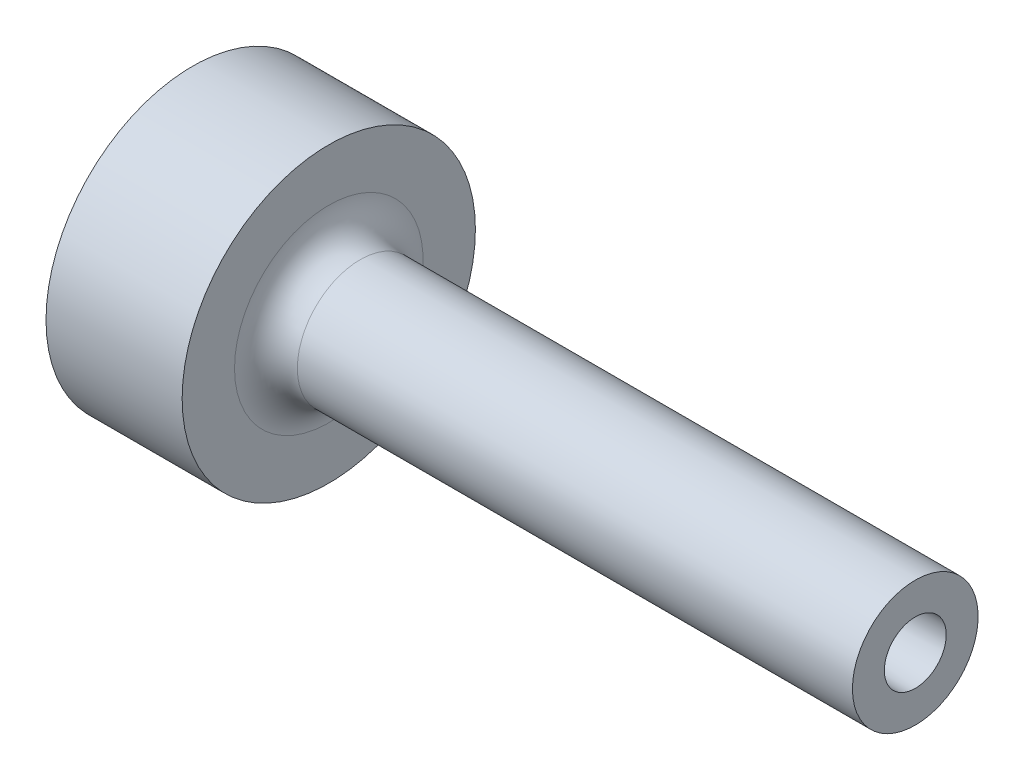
ISO-10303-21;
HEADER;
FILE_DESCRIPTION(('STEP AP214'),'2;1');
FILE_NAME('part.step','',(''),(''),'','','');
FILE_SCHEMA(('AUTOMOTIVE_DESIGN { 1 0 10303 214 1 1 1 1 }'));
ENDSEC;
DATA;
#1=APPLICATION_CONTEXT('core data for automotive mechanical design processes');
#2=APPLICATION_PROTOCOL_DEFINITION('international standard','automotive_design',2000,#1);
#3=PRODUCT_CONTEXT('',#1,'mechanical');
#4=PRODUCT('Part','Part','',(#3));
#5=PRODUCT_RELATED_PRODUCT_CATEGORY('part','',(#4));
#6=PRODUCT_DEFINITION_FORMATION('','',#4);
#7=PRODUCT_DEFINITION_CONTEXT('part definition',#1,'design');
#8=PRODUCT_DEFINITION('design','',#6,#7);
#9=PRODUCT_DEFINITION_SHAPE('','',#8);
#10=(LENGTH_UNIT() NAMED_UNIT(*) SI_UNIT(.MILLI.,.METRE.));
#11=(NAMED_UNIT(*) PLANE_ANGLE_UNIT() SI_UNIT($,.RADIAN.));
#12=(NAMED_UNIT(*) SI_UNIT($,.STERADIAN.) SOLID_ANGLE_UNIT());
#13=UNCERTAINTY_MEASURE_WITH_UNIT(LENGTH_MEASURE(1.E-05),#10,'distance_accuracy_value','');
#14=(GEOMETRIC_REPRESENTATION_CONTEXT(3) GLOBAL_UNCERTAINTY_ASSIGNED_CONTEXT((#13)) GLOBAL_UNIT_ASSIGNED_CONTEXT((#10,
#11,#12)) REPRESENTATION_CONTEXT('',''));
#15=CARTESIAN_POINT('',(0.,0.,0.));
#16=DIRECTION('',(0.,0.,1.));
#17=DIRECTION('',(1.,0.,0.));
#18=AXIS2_PLACEMENT_3D('',#15,#16,#17);
#19=CARTESIAN_POINT('',(0.,0.,0.));
#20=DIRECTION('',(-1.,0.,0.));
#21=DIRECTION('',(0.,0.,1.));
#22=AXIS2_PLACEMENT_3D('',#19,#20,#21);
#23=CYLINDRICAL_SURFACE('',#22,14.);
#24=CARTESIAN_POINT('',(13.,0.,0.));
#25=DIRECTION('',(-1.,0.,0.));
#26=DIRECTION('',(0.,0.,1.));
#27=AXIS2_PLACEMENT_3D('',#24,#25,#26);
#28=CIRCLE('',#27,14.);
#29=CARTESIAN_POINT('',(13.,0.,14.));
#30=VERTEX_POINT('',#29);
#31=EDGE_CURVE('E89',#30,#30,#28,.T.);
#32=ORIENTED_EDGE('',*,*,#31,.T.);
#33=EDGE_LOOP('',(#32));
#34=FACE_BOUND('',#33,.T.);
#35=CARTESIAN_POINT('',(0.,0.,0.));
#36=DIRECTION('',(-1.,0.,0.));
#37=DIRECTION('',(0.,0.,1.));
#38=AXIS2_PLACEMENT_3D('',#35,#36,#37);
#39=CIRCLE('',#38,14.);
#40=CARTESIAN_POINT('',(0.,0.,14.));
#41=VERTEX_POINT('',#40);
#42=EDGE_CURVE('E84',#41,#41,#39,.T.);
#43=ORIENTED_EDGE('',*,*,#42,.F.);
#44=EDGE_LOOP('',(#43));
#45=FACE_BOUND('',#44,.T.);
#46=CARTESIAN_POINT('',(6.5,-13.856406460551,-2.));
#47=CARTESIAN_POINT('',(6.61172417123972,-13.8564082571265,-1.99999534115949));
#48=CARTESIAN_POINT('',(6.72351471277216,-13.8577723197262,-1.99060664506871));
#49=CARTESIAN_POINT('',(6.9439746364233,-13.8630779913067,-1.95330740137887));
#50=CARTESIAN_POINT('',(7.05264079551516,-13.8670221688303,-1.92537839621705));
#51=CARTESIAN_POINT('',(7.26362870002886,-13.8770324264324,-1.85184738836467));
#52=CARTESIAN_POINT('',(7.36595507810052,-13.8830969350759,-1.80625847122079));
#53=CARTESIAN_POINT('',(7.56148972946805,-13.8966626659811,-1.69873175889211));
#54=CARTESIAN_POINT('',(7.65469934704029,-13.9041636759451,-1.63679637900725));
#55=CARTESIAN_POINT('',(7.83004829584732,-13.9198182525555,-1.49785346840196));
#56=CARTESIAN_POINT('',(7.91211171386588,-13.9279757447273,-1.42075056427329));
#57=CARTESIAN_POINT('',(8.06218155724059,-13.9439890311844,-1.25386707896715));
#58=CARTESIAN_POINT('',(8.13018723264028,-13.9518448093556,-1.16408582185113));
#59=CARTESIAN_POINT('',(8.25048909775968,-13.9664103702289,-0.973910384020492));
#60=CARTESIAN_POINT('',(8.30271571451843,-13.9731150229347,-0.873471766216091));
#61=CARTESIAN_POINT('',(8.38953073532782,-13.9845795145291,-0.665136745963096));
#62=CARTESIAN_POINT('',(8.4241199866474,-13.9893394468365,-0.557240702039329));
#63=CARTESIAN_POINT('',(8.47444920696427,-13.9963505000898,-0.337834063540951));
#64=CARTESIAN_POINT('',(8.49031606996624,-13.9986185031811,-0.226353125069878));
#65=CARTESIAN_POINT('',(8.5031438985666,-14.0004479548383,-0.00228956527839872));
#66=CARTESIAN_POINT('',(8.50010582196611,-14.0000095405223,0.110292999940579));
#67=CARTESIAN_POINT('',(8.47531062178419,-13.9964890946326,0.33249899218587));
#68=CARTESIAN_POINT('',(8.45369000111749,-13.9934263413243,0.442137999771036));
#69=CARTESIAN_POINT('',(8.39255744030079,-13.9850228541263,0.656215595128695));
#70=CARTESIAN_POINT('',(8.3530450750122,-13.9796820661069,0.760654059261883));
#71=CARTESIAN_POINT('',(8.25710925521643,-13.9672894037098,0.961781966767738));
#72=CARTESIAN_POINT('',(8.20062784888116,-13.9602316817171,1.05844339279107));
#73=CARTESIAN_POINT('',(8.07239950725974,-13.9451926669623,1.24096782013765));
#74=CARTESIAN_POINT('',(8.00065165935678,-13.9372113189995,1.32683017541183));
#75=CARTESIAN_POINT('',(7.843165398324,-13.921132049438,1.48612299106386));
#76=CARTESIAN_POINT('',(7.75730786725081,-13.9130337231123,1.55943569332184));
#77=CARTESIAN_POINT('',(7.57444547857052,-13.8977029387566,1.69062989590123));
#78=CARTESIAN_POINT('',(7.47744056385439,-13.890470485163,1.74851131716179));
#79=CARTESIAN_POINT('',(7.27491971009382,-13.8776905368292,1.84721301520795));
#80=CARTESIAN_POINT('',(7.1693981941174,-13.8721441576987,1.88802200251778));
#81=CARTESIAN_POINT('',(6.95290242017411,-13.8633846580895,1.9513062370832));
#82=CARTESIAN_POINT('',(6.84192850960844,-13.8601713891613,1.97378265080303));
#83=CARTESIAN_POINT('',(6.61872346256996,-13.8564698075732,1.99960390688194));
#84=CARTESIAN_POINT('',(6.50651197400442,-13.8559577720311,2.00311531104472));
#85=CARTESIAN_POINT('',(6.28310219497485,-13.8576537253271,1.9913480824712));
#86=CARTESIAN_POINT('',(6.17190387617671,-13.8598616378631,1.9760699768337));
#87=CARTESIAN_POINT('',(5.95418781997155,-13.8667269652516,1.92729837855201));
#88=CARTESIAN_POINT('',(5.84765127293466,-13.8713733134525,1.8938871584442));
#89=CARTESIAN_POINT('',(5.6416912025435,-13.8825829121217,1.80988306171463));
#90=CARTESIAN_POINT('',(5.54226800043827,-13.8891462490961,1.75928940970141));
#91=CARTESIAN_POINT('',(5.35260812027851,-13.9035064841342,1.64195360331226));
#92=CARTESIAN_POINT('',(5.26243903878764,-13.911311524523,1.57510320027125));
#93=CARTESIAN_POINT('',(5.09454027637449,-13.9272509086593,1.42730277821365));
#94=CARTESIAN_POINT('',(5.01681123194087,-13.9353852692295,1.34635203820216));
#95=CARTESIAN_POINT('',(4.8754047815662,-13.9511405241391,1.17191708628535));
#96=CARTESIAN_POINT('',(4.81183747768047,-13.9587570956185,1.07834317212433));
#97=CARTESIAN_POINT('',(4.70132443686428,-13.972552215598,0.881748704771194));
#98=CARTESIAN_POINT('',(4.65437828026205,-13.9787308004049,0.778728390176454));
#99=CARTESIAN_POINT('',(4.57861788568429,-13.9889347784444,0.566515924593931));
#100=CARTESIAN_POINT('',(4.54974241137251,-13.9929674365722,0.457345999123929));
#101=CARTESIAN_POINT('',(4.51074453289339,-13.9984555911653,0.235645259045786));
#102=CARTESIAN_POINT('',(4.50062101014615,-13.9999112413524,0.123114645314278));
#103=CARTESIAN_POINT('',(4.49943976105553,-14.0000800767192,-0.101043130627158));
#104=CARTESIAN_POINT('',(4.50821318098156,-13.998817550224,-0.212669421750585));
#105=CARTESIAN_POINT('',(4.54421615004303,-13.9937406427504,-0.432842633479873));
#106=CARTESIAN_POINT('',(4.57144565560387,-13.989926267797,-0.541389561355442));
#107=CARTESIAN_POINT('',(4.6435299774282,-13.9801722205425,-0.752283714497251));
#108=CARTESIAN_POINT('',(4.68837418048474,-13.9742338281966,-0.854634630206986));
#109=CARTESIAN_POINT('',(4.79439714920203,-13.960885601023,-1.05038570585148));
#110=CARTESIAN_POINT('',(4.8555763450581,-13.9534757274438,-1.14378562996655));
#111=CARTESIAN_POINT('',(4.99314771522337,-13.9379304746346,-1.31984194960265));
#112=CARTESIAN_POINT('',(5.06966490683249,-13.9297894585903,-1.40240016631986));
#113=CARTESIAN_POINT('',(5.2354775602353,-13.9137422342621,-1.55356716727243));
#114=CARTESIAN_POINT('',(5.32477602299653,-13.9058360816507,-1.6221726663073));
#115=CARTESIAN_POINT('',(5.51414543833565,-13.8911108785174,-1.74379523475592));
#116=CARTESIAN_POINT('',(5.61426869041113,-13.8842975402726,-1.79673154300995));
#117=CARTESIAN_POINT('',(5.82203229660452,-13.8725962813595,-1.88495902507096));
#118=CARTESIAN_POINT('',(5.92966459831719,-13.8677063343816,-1.92026877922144));
#119=CARTESIAN_POINT('',(6.11483642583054,-13.8615529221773,-1.96409255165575));
#120=CARTESIAN_POINT('',(6.19122433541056,-13.859633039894,-1.97753762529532));
#121=CARTESIAN_POINT('',(6.34506419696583,-13.857059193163,-1.99549291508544));
#122=CARTESIAN_POINT('',(6.42251613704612,-13.8564052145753,-2.00000323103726));
#123=CARTESIAN_POINT('',(6.5,-13.856406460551,-2.));
#124=B_SPLINE_CURVE_WITH_KNOTS('',3,(#46,#47,#48,#49,#50,#51,#52,#53,#54,#55,#56,#57,#58,#59,
#60,#61,#62,#63,#64,#65,#66,#67,#68,#69,#70,#71,#72,#73,#74,#75,#76,#77,#78,#79,#80,#81,#82,#83,
#84,#85,#86,#87,#88,#89,#90,#91,#92,#93,#94,#95,#96,#97,#98,#99,#100,#101,#102,#103,#104,#105,
#106,#107,#108,#109,#110,#111,#112,#113,#114,#115,#116,#117,#118,#119,#120,#121,#122,#123),
.UNSPECIFIED.,.T.,.F.,(4,2,2,2,2,2,2,2,2,2,2,2,2,2,2,2,2,2,2,2,2,2,2,2,2,2,2,2,2,2,2,2,2,2,2,2,
2,2,4),(0.,0.334889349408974,0.670112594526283,1.00508792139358,1.34001378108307,
1.6771171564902,2.01423851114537,2.35282530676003,2.6913958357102,3.02765822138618,
3.36390357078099,3.69769984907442,4.03150405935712,4.36646147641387,4.70143892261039,
5.03940517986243,5.37737316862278,5.7155642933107,6.05373389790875,6.3889286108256,
6.72411392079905,7.05779100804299,7.39148315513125,7.72746121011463,8.06345644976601,
8.40197921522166,8.74049343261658,9.07785422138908,9.41519488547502,9.74953375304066,
10.083871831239,10.4180087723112,10.7521545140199,11.0891434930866,11.426211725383,
11.7649881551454,12.103406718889,12.3356645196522,12.5679197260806),.UNSPECIFIED.);
#125=CARTESIAN_POINT('',(6.5,-13.856406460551,-2.));
#126=VERTEX_POINT('',#125);
#127=EDGE_CURVE('E10',#126,#126,#124,.T.);
#128=ORIENTED_EDGE('',*,*,#127,.F.);
#129=EDGE_LOOP('',(#128));
#130=FACE_BOUND('',#129,.T.);
#131=ADVANCED_FACE('F16',(#34,#45,#130),#23,.T.);
#132=CARTESIAN_POINT('',(0.,0.,0.));
#133=DIRECTION('',(1.,0.,0.));
#134=DIRECTION('',(0.,0.,-1.));
#135=AXIS2_PLACEMENT_3D('',#132,#133,#134);
#136=CONICAL_SURFACE('',#135,1.75,0.0174532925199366);
#137=CARTESIAN_POINT('',(69.,0.,0.));
#138=DIRECTION('',(-1.,0.,0.));
#139=DIRECTION('',(0.,0.,1.));
#140=AXIS2_PLACEMENT_3D('',#137,#138,#139);
#141=CIRCLE('',#140,2.95439948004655);
#142=CARTESIAN_POINT('',(69.,0.,2.95439948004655));
#143=VERTEX_POINT('',#142);
#144=EDGE_CURVE('E81',#143,#143,#141,.T.);
#145=ORIENTED_EDGE('',*,*,#144,.F.);
#146=EDGE_LOOP('',(#145));
#147=FACE_BOUND('',#146,.T.);
#148=CARTESIAN_POINT('',(0.8568945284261,0.,0.));
#149=DIRECTION('',(-1.,0.,0.));
#150=DIRECTION('',(0.,0.,1.));
#151=AXIS2_PLACEMENT_3D('',#148,#149,#150);
#152=CIRCLE('',#151,1.76495714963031);
#153=CARTESIAN_POINT('',(0.8568945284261,0.,1.76495714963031));
#154=VERTEX_POINT('',#153);
#155=EDGE_CURVE('E94',#154,#154,#152,.F.);
#156=ORIENTED_EDGE('',*,*,#155,.F.);
#157=EDGE_LOOP('',(#156));
#158=FACE_BOUND('',#157,.T.);
#159=ADVANCED_FACE('F45',(#147,#158),#136,.F.);
#160=CARTESIAN_POINT('',(16.,0.,0.));
#161=DIRECTION('',(-1.,0.,0.));
#162=DIRECTION('',(0.,0.,1.));
#163=AXIS2_PLACEMENT_3D('',#160,#161,#162);
#164=TOROIDAL_SURFACE('',#163,9.,3.);
#165=CARTESIAN_POINT('',(13.,0.,0.));
#166=DIRECTION('',(-1.,0.,0.));
#167=DIRECTION('',(0.,0.,1.));
#168=AXIS2_PLACEMENT_3D('',#165,#166,#167);
#169=CIRCLE('',#168,9.);
#170=CARTESIAN_POINT('',(13.,0.,9.));
#171=VERTEX_POINT('',#170);
#172=EDGE_CURVE('E91',#171,#171,#169,.T.);
#173=ORIENTED_EDGE('',*,*,#172,.F.);
#174=EDGE_LOOP('',(#173));
#175=FACE_BOUND('',#174,.T.);
#176=CARTESIAN_POINT('',(16.,0.,0.));
#177=DIRECTION('',(-1.,0.,0.));
#178=DIRECTION('',(0.,0.,1.));
#179=AXIS2_PLACEMENT_3D('',#176,#177,#178);
#180=CIRCLE('',#179,6.);
#181=CARTESIAN_POINT('',(16.,0.,6.));
#182=VERTEX_POINT('',#181);
#183=EDGE_CURVE('E28',#182,#182,#180,.T.);
#184=ORIENTED_EDGE('',*,*,#183,.T.);
#185=EDGE_LOOP('',(#184));
#186=FACE_BOUND('',#185,.T.);
#187=ADVANCED_FACE('F18',(#175,#186),#164,.F.);
#188=CARTESIAN_POINT('',(0.,0.,0.));
#189=DIRECTION('',(-1.,0.,0.));
#190=DIRECTION('',(0.,0.,1.));
#191=AXIS2_PLACEMENT_3D('',#188,#189,#190);
#192=CYLINDRICAL_SURFACE('',#191,6.);
#193=ORIENTED_EDGE('',*,*,#183,.F.);
#194=EDGE_LOOP('',(#193));
#195=FACE_BOUND('',#194,.T.);
#196=CARTESIAN_POINT('',(69.,0.,0.));
#197=DIRECTION('',(-1.,0.,0.));
#198=DIRECTION('',(0.,0.,1.));
#199=AXIS2_PLACEMENT_3D('',#196,#197,#198);
#200=CIRCLE('',#199,6.);
#201=CARTESIAN_POINT('',(69.,0.,6.));
#202=VERTEX_POINT('',#201);
#203=EDGE_CURVE('E80',#202,#202,#200,.T.);
#204=ORIENTED_EDGE('',*,*,#203,.T.);
#205=EDGE_LOOP('',(#204));
#206=FACE_BOUND('',#205,.T.);
#207=ADVANCED_FACE('F66',(#195,#206),#192,.T.);
#208=CARTESIAN_POINT('',(69.,6.,0.));
#209=DIRECTION('',(-1.,0.,0.));
#210=DIRECTION('',(0.,0.,1.));
#211=AXIS2_PLACEMENT_3D('',#208,#209,#210);
#212=PLANE('',#211);
#213=ORIENTED_EDGE('',*,*,#203,.F.);
#214=EDGE_LOOP('',(#213));
#215=FACE_BOUND('',#214,.T.);
#216=ORIENTED_EDGE('',*,*,#144,.T.);
#217=EDGE_LOOP('',(#216));
#218=FACE_BOUND('',#217,.T.);
#219=ADVANCED_FACE('F62',(#215,#218),#212,.F.);
#220=CARTESIAN_POINT('',(0.,1.75,0.));
#221=DIRECTION('',(1.,0.,0.));
#222=DIRECTION('',(0.,0.,-1.));
#223=AXIS2_PLACEMENT_3D('',#220,#221,#222);
#224=PLANE('',#223);
#225=CARTESIAN_POINT('',(0.,0.,0.));
#226=DIRECTION('',(-1.,0.,0.));
#227=DIRECTION('',(0.,0.,1.));
#228=AXIS2_PLACEMENT_3D('',#225,#226,#227);
#229=CIRCLE('',#228,5.);
#230=CARTESIAN_POINT('',(0.,0.,5.));
#231=VERTEX_POINT('',#230);
#232=EDGE_CURVE('E97',#231,#231,#229,.T.);
#233=ORIENTED_EDGE('',*,*,#232,.F.);
#234=EDGE_LOOP('',(#233));
#235=FACE_BOUND('',#234,.T.);
#236=ORIENTED_EDGE('',*,*,#42,.T.);
#237=EDGE_LOOP('',(#236));
#238=FACE_BOUND('',#237,.T.);
#239=ADVANCED_FACE('F60',(#235,#238),#224,.F.);
#240=CARTESIAN_POINT('',(13.,14.,0.));
#241=DIRECTION('',(-1.,0.,0.));
#242=DIRECTION('',(0.,0.,1.));
#243=AXIS2_PLACEMENT_3D('',#240,#241,#242);
#244=PLANE('',#243);
#245=ORIENTED_EDGE('',*,*,#31,.F.);
#246=EDGE_LOOP('',(#245));
#247=FACE_BOUND('',#246,.T.);
#248=ORIENTED_EDGE('',*,*,#172,.T.);
#249=EDGE_LOOP('',(#248));
#250=FACE_BOUND('',#249,.T.);
#251=ADVANCED_FACE('F58',(#247,#250),#244,.F.);
#252=CARTESIAN_POINT('',(-14.4672767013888,0.,0.));
#253=DIRECTION('',(-1.,0.,0.));
#254=DIRECTION('',(0.,0.,1.));
#255=AXIS2_PLACEMENT_3D('',#252,#253,#254);
#256=DEGENERATE_TOROIDAL_SURFACE('',#255,0.56308411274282,15.5,.F.);
#257=ORIENTED_EDGE('',*,*,#232,.T.);
#258=EDGE_LOOP('',(#257));
#259=FACE_BOUND('',#258,.T.);
#260=ORIENTED_EDGE('',*,*,#155,.T.);
#261=EDGE_LOOP('',(#260));
#262=FACE_BOUND('',#261,.T.);
#263=ADVANCED_FACE('F41',(#259,#262),#256,.T.);
#264=CARTESIAN_POINT('',(6.5,-14.,0.));
#265=DIRECTION('',(0.,-1.,0.));
#266=DIRECTION('',(0.,0.,-1.));
#267=AXIS2_PLACEMENT_3D('',#264,#265,#266);
#268=CYLINDRICAL_SURFACE('',#267,2.);
#269=CARTESIAN_POINT('',(6.5,-8.,0.));
#270=DIRECTION('',(0.,-1.,0.));
#271=DIRECTION('',(0.,0.,-1.));
#272=AXIS2_PLACEMENT_3D('',#269,#270,#271);
#273=CIRCLE('',#272,2.);
#274=CARTESIAN_POINT('',(6.5,-8.,-2.));
#275=VERTEX_POINT('',#274);
#276=EDGE_CURVE('E100',#275,#275,#273,.T.);
#277=ORIENTED_EDGE('',*,*,#276,.F.);
#278=EDGE_LOOP('',(#277));
#279=FACE_BOUND('',#278,.T.);
#280=ORIENTED_EDGE('',*,*,#127,.T.);
#281=EDGE_LOOP('',(#280));
#282=FACE_BOUND('',#281,.T.);
#283=ADVANCED_FACE('F33',(#279,#282),#268,.F.);
#284=CARTESIAN_POINT('',(6.5,-6.84529946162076,0.));
#285=DIRECTION('',(0.,-1.,0.));
#286=DIRECTION('',(0.,0.,-1.));
#287=AXIS2_PLACEMENT_3D('',#284,#285,#286);
#288=CONICAL_SURFACE('',#287,0.,1.0471975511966);
#289=ORIENTED_EDGE('',*,*,#276,.T.);
#290=EDGE_LOOP('',(#289));
#291=FACE_BOUND('',#290,.T.);
#292=CARTESIAN_POINT('',(6.5,-6.84529946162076,0.));
#293=VERTEX_POINT('',#292);
#294=VERTEX_LOOP('',#293);
#295=FACE_BOUND('',#294,.T.);
#296=ADVANCED_FACE('F31',(#291,#295),#288,.F.);
#297=CLOSED_SHELL('',(#131,#159,#187,#207,#219,#239,#251,#263,#283,#296));
#298=MANIFOLD_SOLID_BREP('B1',#297);
#299=ADVANCED_BREP_SHAPE_REPRESENTATION('',(#18,#298),#14);
#300=SHAPE_DEFINITION_REPRESENTATION(#9,#299);
ENDSEC;
END-ISO-10303-21;
